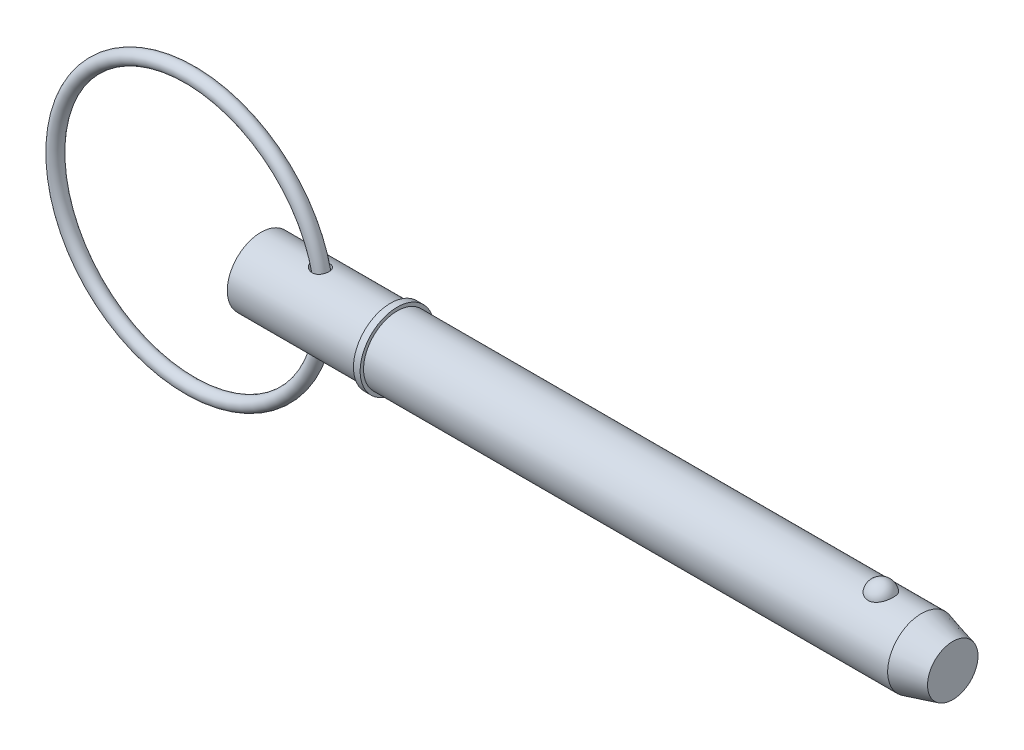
ISO-10303-21;
HEADER;
FILE_DESCRIPTION(('STEP AP214'),'2;1');
FILE_NAME('part.step','',(''),(''),'','','');
FILE_SCHEMA(('AUTOMOTIVE_DESIGN { 1 0 10303 214 1 1 1 1 }'));
ENDSEC;
DATA;
#1=APPLICATION_CONTEXT('core data for automotive mechanical design processes');
#2=APPLICATION_PROTOCOL_DEFINITION('international standard','automotive_design',2000,#1);
#3=PRODUCT_CONTEXT('',#1,'mechanical');
#4=PRODUCT('Part','Part','',(#3));
#5=PRODUCT_RELATED_PRODUCT_CATEGORY('part','',(#4));
#6=PRODUCT_DEFINITION_FORMATION('','',#4);
#7=PRODUCT_DEFINITION_CONTEXT('part definition',#1,'design');
#8=PRODUCT_DEFINITION('design','',#6,#7);
#9=PRODUCT_DEFINITION_SHAPE('','',#8);
#10=(LENGTH_UNIT() NAMED_UNIT(*) SI_UNIT(.MILLI.,.METRE.));
#11=(NAMED_UNIT(*) PLANE_ANGLE_UNIT() SI_UNIT($,.RADIAN.));
#12=(NAMED_UNIT(*) SI_UNIT($,.STERADIAN.) SOLID_ANGLE_UNIT());
#13=UNCERTAINTY_MEASURE_WITH_UNIT(LENGTH_MEASURE(1.E-05),#10,'distance_accuracy_value','');
#14=(GEOMETRIC_REPRESENTATION_CONTEXT(3) GLOBAL_UNCERTAINTY_ASSIGNED_CONTEXT((#13)) GLOBAL_UNIT_ASSIGNED_CONTEXT((#10,
#11,#12)) REPRESENTATION_CONTEXT('',''));
#15=CARTESIAN_POINT('',(0.,0.,0.));
#16=DIRECTION('',(0.,0.,1.));
#17=DIRECTION('',(1.,0.,0.));
#18=AXIS2_PLACEMENT_3D('',#15,#16,#17);
#19=CARTESIAN_POINT('',(-13.3798047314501,0.,0.));
#20=DIRECTION('',(0.,0.,1.));
#21=DIRECTION('',(1.,0.,0.));
#22=AXIS2_PLACEMENT_3D('',#19,#20,#21);
#23=TOROIDAL_SURFACE('',#22,25.4,1.27);
#24=CARTESIAN_POINT('',(13.2901952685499,0.,0.));
#25=VERTEX_POINT('',#24);
#26=VERTEX_LOOP('',#25);
#27=FACE_BOUND('',#26,.T.);
#28=ADVANCED_FACE('P0_F12',(#27),#23,.T.);
#29=CLOSED_SHELL('',(#28));
#30=MANIFOLD_SOLID_BREP('P0_B1',#29);
#31=CARTESIAN_POINT('',(0.,0.,0.));
#32=DIRECTION('',(1.,0.,0.));
#33=DIRECTION('',(0.,0.,-1.));
#34=AXIS2_PLACEMENT_3D('',#31,#32,#33);
#35=CYLINDRICAL_SURFACE('',#34,6.35);
#36=CARTESIAN_POINT('',(9.67500140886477,6.32698634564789,-0.540133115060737));
#37=CARTESIAN_POINT('',(9.70878953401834,6.3197498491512,-0.624879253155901));
#38=CARTESIAN_POINT('',(9.75028044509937,6.31105328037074,-0.706504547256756));
#39=CARTESIAN_POINT('',(9.84659255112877,6.29180070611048,-0.861319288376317));
#40=CARTESIAN_POINT('',(9.90144039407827,6.28124099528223,-0.934491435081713));
#41=CARTESIAN_POINT('',(10.021999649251,6.25949497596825,-1.0704877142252));
#42=CARTESIAN_POINT('',(10.0876589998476,6.2483118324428,-1.13335868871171));
#43=CARTESIAN_POINT('',(10.2280180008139,6.22641783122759,-1.24805262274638));
#44=CARTESIAN_POINT('',(10.3027159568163,6.21570688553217,-1.29987764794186));
#45=CARTESIAN_POINT('',(10.4650889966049,6.19509606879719,-1.39492899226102));
#46=CARTESIAN_POINT('',(10.5533142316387,6.1853135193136,-1.4372443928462));
#47=CARTESIAN_POINT('',(10.7357818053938,6.16871128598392,-1.50691441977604));
#48=CARTESIAN_POINT('',(10.8300253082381,6.16189217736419,-1.53426614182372));
#49=CARTESIAN_POINT('',(11.0227953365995,6.15211299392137,-1.57302798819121));
#50=CARTESIAN_POINT('',(11.1213511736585,6.14918579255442,-1.58430237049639));
#51=CARTESIAN_POINT('',(11.3189518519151,6.1478413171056,-1.58951619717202));
#52=CARTESIAN_POINT('',(11.417996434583,6.14942187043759,-1.58346399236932));
#53=CARTESIAN_POINT('',(11.6070859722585,6.15678569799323,-1.55457003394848));
#54=CARTESIAN_POINT('',(11.6973059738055,6.16229943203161,-1.53280404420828));
#55=CARTESIAN_POINT('',(11.8723373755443,6.17663058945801,-1.4739892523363));
#56=CARTESIAN_POINT('',(11.9571502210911,6.185447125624,-1.43694455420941));
#57=CARTESIAN_POINT('',(12.1146737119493,6.20482821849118,-1.35072170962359));
#58=CARTESIAN_POINT('',(12.1877743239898,6.21528554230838,-1.30222952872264));
#59=CARTESIAN_POINT('',(12.3246187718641,6.23705116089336,-1.19362916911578));
#60=CARTESIAN_POINT('',(12.3883628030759,6.24835943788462,-1.1335212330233));
#61=CARTESIAN_POINT('',(12.5046662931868,6.27053957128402,-1.00357204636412));
#62=CARTESIAN_POINT('',(12.5572571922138,6.28141258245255,-0.933759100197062));
#63=CARTESIAN_POINT('',(12.6502125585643,6.30157953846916,-0.786214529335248));
#64=CARTESIAN_POINT('',(12.6905764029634,6.31087340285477,-0.708482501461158));
#65=CARTESIAN_POINT('',(12.7585531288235,6.32699259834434,-0.546246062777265));
#66=CARTESIAN_POINT('',(12.7860022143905,6.33378599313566,-0.46166981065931));
#67=CARTESIAN_POINT('',(12.8267605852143,6.34401050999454,-0.288980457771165));
#68=CARTESIAN_POINT('',(12.8400695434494,6.34744155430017,-0.200867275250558));
#69=CARTESIAN_POINT('',(12.8522644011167,6.35058177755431,-0.023194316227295));
#70=CARTESIAN_POINT('',(12.8510870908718,6.35027464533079,0.0663700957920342));
#71=CARTESIAN_POINT('',(12.8341831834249,6.34593169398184,0.244024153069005));
#72=CARTESIAN_POINT('',(12.8184563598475,6.341895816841,0.332113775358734));
#73=CARTESIAN_POINT('',(12.7728208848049,6.33052992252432,0.504322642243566));
#74=CARTESIAN_POINT('',(12.7429114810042,6.32319973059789,0.58844167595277));
#75=CARTESIAN_POINT('',(12.6696162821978,6.30604116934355,0.750316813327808));
#76=CARTESIAN_POINT('',(12.6262302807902,6.29621276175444,0.828072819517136));
#77=CARTESIAN_POINT('',(12.5270856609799,6.27515240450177,0.974918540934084));
#78=CARTESIAN_POINT('',(12.4713403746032,6.26392197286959,1.04401746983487));
#79=CARTESIAN_POINT('',(12.3488662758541,6.24131002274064,1.1716478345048));
#80=CARTESIAN_POINT('',(12.2821384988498,6.22992851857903,1.23018026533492));
#81=CARTESIAN_POINT('',(12.1401870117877,6.20841765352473,1.33449214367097));
#82=CARTESIAN_POINT('',(12.0650507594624,6.19827734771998,1.38038832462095));
#83=CARTESIAN_POINT('',(11.9079044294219,6.18026478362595,1.45892404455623));
#84=CARTESIAN_POINT('',(11.8258951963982,6.17239224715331,1.49156520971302));
#85=CARTESIAN_POINT('',(11.6581736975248,6.15982613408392,1.54263810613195));
#86=CARTESIAN_POINT('',(11.572502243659,6.15510409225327,1.56119728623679));
#87=CARTESIAN_POINT('',(11.3991899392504,6.14916283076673,1.58443707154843));
#88=CARTESIAN_POINT('',(11.3115488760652,6.14794399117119,1.58911617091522));
#89=CARTESIAN_POINT('',(11.1345547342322,6.14904466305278,1.58485137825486));
#90=CARTESIAN_POINT('',(11.0452104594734,6.15144894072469,1.5755811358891));
#91=CARTESIAN_POINT('',(10.8691479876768,6.15957601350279,1.54349959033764));
#92=CARTESIAN_POINT('',(10.782430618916,6.16529984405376,1.52068406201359));
#93=CARTESIAN_POINT('',(10.6082848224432,6.17983892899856,1.4605156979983));
#94=CARTESIAN_POINT('',(10.5211557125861,6.1888262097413,1.42233764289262));
#95=CARTESIAN_POINT('',(10.3542377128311,6.20874782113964,1.33268652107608));
#96=CARTESIAN_POINT('',(10.2744521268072,6.21968302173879,1.28120750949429));
#97=CARTESIAN_POINT('',(10.120854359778,6.24282707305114,1.16334748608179));
#98=CARTESIAN_POINT('',(10.0474902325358,6.25507146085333,1.09638652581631));
#99=CARTESIAN_POINT('',(9.9136869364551,6.27890019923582,0.950453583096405));
#100=CARTESIAN_POINT('',(9.85324511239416,6.29048468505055,0.871484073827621));
#101=CARTESIAN_POINT('',(9.75037543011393,6.31102161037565,0.707140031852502));
#102=CARTESIAN_POINT('',(9.70726585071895,6.32006820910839,0.622206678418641));
#103=CARTESIAN_POINT('',(9.63775895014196,6.33497125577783,0.445490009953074));
#104=CARTESIAN_POINT('',(9.61134627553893,6.34083063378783,0.35371307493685));
#105=CARTESIAN_POINT('',(9.57891955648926,6.34807071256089,0.177220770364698));
#106=CARTESIAN_POINT('',(9.57093524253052,6.3498832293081,0.0928817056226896));
#107=CARTESIAN_POINT('',(9.56994851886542,6.35010532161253,-0.0758268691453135));
#108=CARTESIAN_POINT('',(9.57692695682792,6.34851924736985,-0.160196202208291));
#109=CARTESIAN_POINT('',(9.59985709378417,6.34339435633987,-0.294043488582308));
#110=CARTESIAN_POINT('',(9.61128951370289,6.34084912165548,-0.344385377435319));
#111=CARTESIAN_POINT('',(9.63933183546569,6.33468615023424,-0.443526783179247));
#112=CARTESIAN_POINT('',(9.65594100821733,6.33106856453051,-0.492326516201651));
#113=CARTESIAN_POINT('',(9.67500140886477,6.32698634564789,-0.540133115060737));
#114=B_SPLINE_CURVE_WITH_KNOTS('',3,(#36,#37,#38,#39,#40,#41,#42,#43,#44,#45,#46,#47,#48,#49,
#50,#51,#52,#53,#54,#55,#56,#57,#58,#59,#60,#61,#62,#63,#64,#65,#66,#67,#68,#69,#70,#71,#72,#73,
#74,#75,#76,#77,#78,#79,#80,#81,#82,#83,#84,#85,#86,#87,#88,#89,#90,#91,#92,#93,#94,#95,#96,#97,
#98,#99,#100,#101,#102,#103,#104,#105,#106,#107,#108,#109,#110,#111,#112,#113),.UNSPECIFIED.,
.T.,.F.,(4,2,2,2,2,2,2,2,2,2,2,2,2,2,2,2,2,2,2,2,2,2,2,2,2,2,2,2,2,2,2,2,2,2,2,2,2,2,4),(0.,
0.274348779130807,0.549249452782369,0.822863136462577,1.09642560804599,1.39007706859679,
1.68378550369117,1.97995934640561,2.27599046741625,2.55347281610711,2.83088067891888,
3.09465189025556,3.35841759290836,3.62142956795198,3.88445494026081,4.1507318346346,
4.4170148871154,4.68446025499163,4.95190978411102,5.21937350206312,5.48684131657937,
5.75402200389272,6.02117751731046,6.28577524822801,6.55034050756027,6.81248178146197,
7.0746514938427,7.34305086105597,7.61153399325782,7.89692981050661,8.18245340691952,
8.48120635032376,8.77989784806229,9.06530254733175,9.35044442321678,9.60331609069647,
9.85586427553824,10.010650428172,10.1654147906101),.UNSPECIFIED.);
#115=CARTESIAN_POINT('',(9.67500140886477,6.32698634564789,-0.540133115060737));
#116=VERTEX_POINT('',#115);
#117=EDGE_CURVE('P1_E42',#116,#116,#114,.T.);
#118=ORIENTED_EDGE('',*,*,#117,.T.);
#119=EDGE_LOOP('',(#118));
#120=FACE_BOUND('',#119,.T.);
#121=CARTESIAN_POINT('',(0.,0.,0.));
#122=DIRECTION('',(1.,0.,0.));
#123=DIRECTION('',(0.,0.,-1.));
#124=AXIS2_PLACEMENT_3D('',#121,#122,#123);
#125=CIRCLE('',#124,6.35);
#126=CARTESIAN_POINT('',(0.,0.,-6.35));
#127=VERTEX_POINT('',#126);
#128=EDGE_CURVE('P1_E9',#127,#127,#125,.T.);
#129=ORIENTED_EDGE('',*,*,#128,.T.);
#130=EDGE_LOOP('',(#129));
#131=FACE_BOUND('',#130,.T.);
#132=CARTESIAN_POINT('',(24.43,0.,0.));
#133=DIRECTION('',(1.,0.,0.));
#134=DIRECTION('',(0.,0.,-1.));
#135=AXIS2_PLACEMENT_3D('',#132,#133,#134);
#136=CIRCLE('',#135,6.35);
#137=CARTESIAN_POINT('',(24.43,0.,-6.35));
#138=VERTEX_POINT('',#137);
#139=EDGE_CURVE('P1_E25',#138,#138,#136,.T.);
#140=ORIENTED_EDGE('',*,*,#139,.F.);
#141=EDGE_LOOP('',(#140));
#142=FACE_BOUND('',#141,.T.);
#143=CARTESIAN_POINT('',(9.67500140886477,-6.32698634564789,-0.540133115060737));
#144=CARTESIAN_POINT('',(9.64544894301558,-6.33331515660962,-0.466002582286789));
#145=CARTESIAN_POINT('',(9.62177180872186,-6.33852974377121,-0.389437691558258));
#146=CARTESIAN_POINT('',(9.58727043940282,-6.34619174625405,-0.233330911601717));
#147=CARTESIAN_POINT('',(9.57644043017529,-6.34864040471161,-0.153790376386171));
#148=CARTESIAN_POINT('',(9.56819517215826,-6.3505010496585,0.00612071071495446));
#149=CARTESIAN_POINT('',(9.57079639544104,-6.34990930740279,0.0864921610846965));
#150=CARTESIAN_POINT('',(9.58930797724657,-6.3457478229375,0.245607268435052));
#151=CARTESIAN_POINT('',(9.60522046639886,-6.34217760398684,0.324350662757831));
#152=CARTESIAN_POINT('',(9.64931570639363,-6.3324977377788,0.47727605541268));
#153=CARTESIAN_POINT('',(9.67737525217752,-6.32641361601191,0.551495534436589));
#154=CARTESIAN_POINT('',(9.74451510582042,-6.31231128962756,0.694551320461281));
#155=CARTESIAN_POINT('',(9.78359827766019,-6.30429258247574,0.763386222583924));
#156=CARTESIAN_POINT('',(9.87474700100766,-6.28638332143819,0.899414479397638));
#157=CARTESIAN_POINT('',(9.92757481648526,-6.27639669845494,0.966083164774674));
#158=CARTESIAN_POINT('',(10.042675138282,-6.25596164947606,1.09061181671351));
#159=CARTESIAN_POINT('',(10.1049521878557,-6.24551300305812,1.14846751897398));
#160=CARTESIAN_POINT('',(10.2445505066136,-6.22397505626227,1.26024641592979));
#161=CARTESIAN_POINT('',(10.3227711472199,-6.2129394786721,1.31305951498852));
#162=CARTESIAN_POINT('',(10.4867924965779,-6.19263757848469,1.40570084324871));
#163=CARTESIAN_POINT('',(10.5725962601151,-6.18337197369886,1.44552380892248));
#164=CARTESIAN_POINT('',(10.7543302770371,-6.16725983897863,1.51283687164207));
#165=CARTESIAN_POINT('',(10.8505554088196,-6.16056505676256,1.53957358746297));
#166=CARTESIAN_POINT('',(11.0463546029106,-6.15127671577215,1.57628137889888));
#167=CARTESIAN_POINT('',(11.1459276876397,-6.14868197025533,1.58625730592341));
#168=CARTESIAN_POINT('',(11.3414257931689,-6.14810798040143,1.58848000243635));
#169=CARTESIAN_POINT('',(11.4373417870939,-6.14995283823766,1.58140242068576));
#170=CARTESIAN_POINT('',(11.6262783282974,-6.1577972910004,1.55057566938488));
#171=CARTESIAN_POINT('',(11.719300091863,-6.16379511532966,1.52683360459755));
#172=CARTESIAN_POINT('',(11.8934223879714,-6.17873566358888,1.46514575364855));
#173=CARTESIAN_POINT('',(11.9749048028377,-6.18746207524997,1.42822144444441));
#174=CARTESIAN_POINT('',(12.1301362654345,-6.20693584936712,1.3410564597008));
#175=CARTESIAN_POINT('',(12.2038861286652,-6.21768299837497,1.29081719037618));
#176=CARTESIAN_POINT('',(12.3399792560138,-6.23970077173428,1.17972764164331));
#177=CARTESIAN_POINT('',(12.4025430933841,-6.25095401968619,1.11914355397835));
#178=CARTESIAN_POINT('',(12.5166805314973,-6.27296916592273,0.988307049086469));
#179=CARTESIAN_POINT('',(12.568253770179,-6.28373104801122,0.918054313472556));
#180=CARTESIAN_POINT('',(12.6596230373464,-6.3037060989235,0.769081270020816));
#181=CARTESIAN_POINT('',(12.6992956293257,-6.31290263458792,0.690283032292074));
#182=CARTESIAN_POINT('',(12.7652258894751,-6.32862394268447,0.527011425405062));
#183=CARTESIAN_POINT('',(12.7914829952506,-6.33514860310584,0.442537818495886));
#184=CARTESIAN_POINT('',(12.8301436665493,-6.34487485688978,0.269505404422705));
#185=CARTESIAN_POINT('',(12.8424230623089,-6.34804664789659,0.180917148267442));
#186=CARTESIAN_POINT('',(12.8524214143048,-6.35062347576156,0.00286829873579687));
#187=CARTESIAN_POINT('',(12.8501402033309,-6.35002846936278,-0.0865923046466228));
#188=CARTESIAN_POINT('',(12.8310619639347,-6.34513332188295,-0.263931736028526));
#189=CARTESIAN_POINT('',(12.8142517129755,-6.34082980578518,-0.35180904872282));
#190=CARTESIAN_POINT('',(12.7664911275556,-6.32897674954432,-0.523406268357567));
#191=CARTESIAN_POINT('',(12.7355404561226,-6.3214271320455,-0.607126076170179));
#192=CARTESIAN_POINT('',(12.6602298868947,-6.30390232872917,-0.768030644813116));
#193=CARTESIAN_POINT('',(12.6158695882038,-6.29392707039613,-0.84521521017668));
#194=CARTESIAN_POINT('',(12.5148171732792,-6.2726521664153,-0.990836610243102));
#195=CARTESIAN_POINT('',(12.4581254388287,-6.26135256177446,-1.05927371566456));
#196=CARTESIAN_POINT('',(12.33416419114,-6.2387572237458,-1.18510935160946));
#197=CARTESIAN_POINT('',(12.2669484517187,-6.22746174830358,-1.24256086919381));
#198=CARTESIAN_POINT('',(12.1235592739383,-6.20610255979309,-1.34519464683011));
#199=CARTESIAN_POINT('',(12.0473871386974,-6.19603866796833,-1.39037868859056));
#200=CARTESIAN_POINT('',(11.8892714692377,-6.17839642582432,-1.46678006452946));
#201=CARTESIAN_POINT('',(11.8074126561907,-6.17078838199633,-1.49816605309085));
#202=CARTESIAN_POINT('',(11.6394563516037,-6.15869606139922,-1.54712759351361));
#203=CARTESIAN_POINT('',(11.5533589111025,-6.15421174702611,-1.56470331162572));
#204=CARTESIAN_POINT('',(11.3789660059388,-6.14876652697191,-1.58596734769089));
#205=CARTESIAN_POINT('',(11.2906621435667,-6.1478222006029,-1.58959032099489));
#206=CARTESIAN_POINT('',(11.1146029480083,-6.149490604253,-1.58312110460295));
#207=CARTESIAN_POINT('',(11.0268477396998,-6.1521041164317,-1.57302589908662));
#208=CARTESIAN_POINT('',(10.8498668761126,-6.16071031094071,-1.53898332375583));
#209=CARTESIAN_POINT('',(10.7607726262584,-6.16685908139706,-1.51439468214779));
#210=CARTESIAN_POINT('',(10.5876521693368,-6.18189031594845,-1.45181305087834));
#211=CARTESIAN_POINT('',(10.5036282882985,-6.19077402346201,-1.41381396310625));
#212=CARTESIAN_POINT('',(10.3374228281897,-6.2109378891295,-1.32252480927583));
#213=CARTESIAN_POINT('',(10.255708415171,-6.2223355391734,-1.26840756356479));
#214=CARTESIAN_POINT('',(10.1025645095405,-6.24580740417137,-1.14725208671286));
#215=CARTESIAN_POINT('',(10.0311354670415,-6.25788164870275,-1.08021329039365));
#216=CARTESIAN_POINT('',(9.90472699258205,-6.2806176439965,-0.938710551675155));
#217=CARTESIAN_POINT('',(9.84904456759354,-6.29132066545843,-0.864883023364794));
#218=CARTESIAN_POINT('',(9.75129345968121,-6.31084098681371,-0.708496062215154));
#219=CARTESIAN_POINT('',(9.70921094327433,-6.31966019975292,-0.625945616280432));
#220=CARTESIAN_POINT('',(9.67500140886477,-6.32698634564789,-0.540133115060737));
#221=B_SPLINE_CURVE_WITH_KNOTS('',3,(#143,#144,#145,#146,#147,#148,#149,#150,#151,#152,#153,
#154,#155,#156,#157,#158,#159,#160,#161,#162,#163,#164,#165,#166,#167,#168,#169,#170,#171,#172,
#173,#174,#175,#176,#177,#178,#179,#180,#181,#182,#183,#184,#185,#186,#187,#188,#189,#190,#191,
#192,#193,#194,#195,#196,#197,#198,#199,#200,#201,#202,#203,#204,#205,#206,#207,#208,#209,#210,
#211,#212,#213,#214,#215,#216,#217,#218,#219,#220),.UNSPECIFIED.,.T.,.F.,(4,2,2,2,2,2,2,2,2,2,2,
2,2,2,2,2,2,2,2,2,2,2,2,2,2,2,2,2,2,2,2,2,2,2,2,2,2,2,4),(0.,0.239871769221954,
0.479635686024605,0.719693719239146,0.959790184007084,1.19750645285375,1.43528453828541,
1.69117930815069,1.94719750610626,2.23102979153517,2.51497694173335,2.81376497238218,
3.11246650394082,3.39952951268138,3.68647020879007,3.95479420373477,4.22308987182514,
4.48530700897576,4.74753278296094,5.01239119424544,5.27726070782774,5.54446524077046,
5.81167284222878,6.07912387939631,6.34658129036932,6.61404669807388,6.88150382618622,
7.14763644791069,7.41373039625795,7.67647472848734,7.93921589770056,8.20318607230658,
8.46721428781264,8.74390821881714,9.02072813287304,9.31537622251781,9.61003720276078,
9.88799314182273,10.1656654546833),.UNSPECIFIED.);
#222=CARTESIAN_POINT('',(9.67500140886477,-6.32698634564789,-0.540133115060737));
#223=VERTEX_POINT('',#222);
#224=EDGE_CURVE('P1_E17',#223,#223,#221,.T.);
#225=ORIENTED_EDGE('',*,*,#224,.T.);
#226=EDGE_LOOP('',(#225));
#227=FACE_BOUND('',#226,.T.);
#228=ADVANCED_FACE('P1_F13',(#120,#131,#142,#227),#35,.T.);
#229=CARTESIAN_POINT('',(0.,0.,0.));
#230=DIRECTION('',(1.,0.,0.));
#231=DIRECTION('',(0.,0.,-1.));
#232=AXIS2_PLACEMENT_3D('',#229,#230,#231);
#233=CYLINDRICAL_SURFACE('',#232,6.35);
#234=CARTESIAN_POINT('',(124.555369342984,0.,0.));
#235=DIRECTION('',(1.,0.,0.));
#236=DIRECTION('',(0.,0.,-1.));
#237=AXIS2_PLACEMENT_3D('',#234,#235,#236);
#238=CIRCLE('',#237,6.35);
#239=CARTESIAN_POINT('',(124.555369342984,0.,-6.35));
#240=VERTEX_POINT('',#239);
#241=EDGE_CURVE('P1_E99',#240,#240,#238,.T.);
#242=ORIENTED_EDGE('',*,*,#241,.F.);
#243=EDGE_LOOP('',(#242));
#244=FACE_BOUND('',#243,.T.);
#245=CARTESIAN_POINT('',(25.7,0.,0.));
#246=DIRECTION('',(1.,0.,0.));
#247=DIRECTION('',(0.,0.,-1.));
#248=AXIS2_PLACEMENT_3D('',#245,#246,#247);
#249=CIRCLE('',#248,6.35);
#250=CARTESIAN_POINT('',(25.7,0.,-6.35));
#251=VERTEX_POINT('',#250);
#252=EDGE_CURVE('P1_E96',#251,#251,#249,.T.);
#253=ORIENTED_EDGE('',*,*,#252,.T.);
#254=EDGE_LOOP('',(#253));
#255=FACE_BOUND('',#254,.T.);
#256=CARTESIAN_POINT('',(116.930021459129,5.87502187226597,2.40969251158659));
#257=CARTESIAN_POINT('',(116.805030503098,5.87501645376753,2.40969773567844));
#258=CARTESIAN_POINT('',(116.680080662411,5.87916061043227,2.39967292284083));
#259=CARTESIAN_POINT('',(116.433909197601,5.8952311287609,2.35991730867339));
#260=CARTESIAN_POINT('',(116.312686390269,5.90715499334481,2.33019283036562));
#261=CARTESIAN_POINT('',(116.077517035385,5.93739567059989,2.25201402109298));
#262=CARTESIAN_POINT('',(115.963560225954,5.95570321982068,2.2035868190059));
#263=CARTESIAN_POINT('',(115.74557352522,5.99672067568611,2.08937987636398));
#264=CARTESIAN_POINT('',(115.641545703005,6.01943149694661,2.02359652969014));
#265=CARTESIAN_POINT('',(115.442943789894,6.06760647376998,1.87428969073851));
#266=CARTESIAN_POINT('',(115.348726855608,6.09313095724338,1.79031110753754));
#267=CARTESIAN_POINT('',(115.175255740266,6.14375873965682,1.60800178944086));
#268=CARTESIAN_POINT('',(115.096004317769,6.16886196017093,1.50966841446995));
#269=CARTESIAN_POINT('',(114.950845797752,6.21724600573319,1.29645884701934));
#270=CARTESIAN_POINT('',(114.885688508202,6.24039621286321,1.18104158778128));
#271=CARTESIAN_POINT('',(114.774703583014,6.28117277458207,0.940351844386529));
#272=CARTESIAN_POINT('',(114.728877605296,6.29879865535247,0.815078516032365));
#273=CARTESIAN_POINT('',(114.657023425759,6.32692073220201,0.556494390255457));
#274=CARTESIAN_POINT('',(114.631249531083,6.33732517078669,0.423102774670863));
#275=CARTESIAN_POINT('',(114.600988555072,6.34957673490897,0.153542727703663));
#276=CARTESIAN_POINT('',(114.596500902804,6.35142408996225,0.0173743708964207));
#277=CARTESIAN_POINT('',(114.608865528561,6.34638925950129,-0.253036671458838));
#278=CARTESIAN_POINT('',(114.625594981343,6.33955731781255,-0.387285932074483));
#279=CARTESIAN_POINT('',(114.679843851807,6.31794129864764,-0.650851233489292));
#280=CARTESIAN_POINT('',(114.717363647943,6.30315707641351,-0.780167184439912));
#281=CARTESIAN_POINT('',(114.812500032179,6.26711642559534,-1.03041949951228));
#282=CARTESIAN_POINT('',(114.870143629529,6.24585130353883,-1.15134433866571));
#283=CARTESIAN_POINT('',(115.004352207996,6.19905619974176,-1.38129800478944));
#284=CARTESIAN_POINT('',(115.080918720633,6.17352587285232,-1.49032586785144));
#285=CARTESIAN_POINT('',(115.251753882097,6.12080227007,-1.69393164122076));
#286=CARTESIAN_POINT('',(115.346100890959,6.09360200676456,-1.78844209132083));
#287=CARTESIAN_POINT('',(115.550119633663,6.04070434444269,-1.95970536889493));
#288=CARTESIAN_POINT('',(115.659790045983,6.01500681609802,-2.03645972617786));
#289=CARTESIAN_POINT('',(115.889187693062,5.96867714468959,-2.1684564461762));
#290=CARTESIAN_POINT('',(116.008652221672,5.94794910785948,-2.22412062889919));
#291=CARTESIAN_POINT('',(116.256218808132,5.91340580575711,-2.31440992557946));
#292=CARTESIAN_POINT('',(116.384317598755,5.89958794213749,-2.3490429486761));
#293=CARTESIAN_POINT('',(116.638582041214,5.88111049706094,-2.39491590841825));
#294=CARTESIAN_POINT('',(116.764520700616,5.876025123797,-2.40724512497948));
#295=CARTESIAN_POINT('',(117.016786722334,5.87428980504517,-2.41147867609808));
#296=CARTESIAN_POINT('',(117.143114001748,5.87763817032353,-2.40338710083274));
#297=CARTESIAN_POINT('',(117.388417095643,5.89212921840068,-2.36762715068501));
#298=CARTESIAN_POINT('',(117.507499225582,5.90302431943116,-2.34058030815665));
#299=CARTESIAN_POINT('',(117.73924472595,5.93113752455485,-2.26839066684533));
#300=CARTESIAN_POINT('',(117.851907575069,5.94835614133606,-2.2232464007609));
#301=CARTESIAN_POINT('',(118.070400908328,5.98773016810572,-2.11493806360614));
#302=CARTESIAN_POINT('',(118.176028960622,6.00998499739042,-2.05140269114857));
#303=CARTESIAN_POINT('',(118.375300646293,6.05690144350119,-1.90842705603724));
#304=CARTESIAN_POINT('',(118.468941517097,6.08156361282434,-1.82898313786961));
#305=CARTESIAN_POINT('',(118.646675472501,6.13211715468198,-1.65182429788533));
#306=CARTESIAN_POINT('',(118.730055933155,6.15800825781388,-1.55339381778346));
#307=CARTESIAN_POINT('',(118.879790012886,6.20712834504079,-1.34374214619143));
#308=CARTESIAN_POINT('',(118.946140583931,6.23035685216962,-1.23251867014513));
#309=CARTESIAN_POINT('',(119.062345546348,6.27251177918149,-0.996447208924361));
#310=CARTESIAN_POINT('',(119.111607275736,6.29127762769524,-0.871278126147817));
#311=CARTESIAN_POINT('',(119.189614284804,6.3215862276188,-0.613870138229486));
#312=CARTESIAN_POINT('',(119.218359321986,6.33312889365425,-0.481631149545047));
#313=CARTESIAN_POINT('',(119.25477058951,6.34782349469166,-0.213672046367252));
#314=CARTESIAN_POINT('',(119.262413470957,6.35096613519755,-0.0779482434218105));
#315=CARTESIAN_POINT('',(119.256395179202,6.34851322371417,0.19294395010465));
#316=CARTESIAN_POINT('',(119.242734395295,6.3429178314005,0.328112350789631));
#317=CARTESIAN_POINT('',(119.19450361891,6.32360512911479,0.59340618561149));
#318=CARTESIAN_POINT('',(119.160031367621,6.30992579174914,0.723552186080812));
#319=CARTESIAN_POINT('',(119.070953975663,6.27586325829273,0.975834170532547));
#320=CARTESIAN_POINT('',(119.01634761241,6.25547965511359,1.09796966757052));
#321=CARTESIAN_POINT('',(118.88775879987,6.20998183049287,1.33148921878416));
#322=CARTESIAN_POINT('',(118.813674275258,6.18484288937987,1.44281227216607));
#323=CARTESIAN_POINT('',(118.647820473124,6.13258735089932,1.65087683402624));
#324=CARTESIAN_POINT('',(118.556051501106,6.10547078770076,1.74761859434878));
#325=CARTESIAN_POINT('',(118.357183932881,6.0523587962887,1.92350926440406));
#326=CARTESIAN_POINT('',(118.250133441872,6.0263601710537,2.00271146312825));
#327=CARTESIAN_POINT('',(118.023138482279,5.97843747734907,2.14154159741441));
#328=CARTESIAN_POINT('',(117.903191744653,5.95651412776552,2.20116608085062));
#329=CARTESIAN_POINT('',(117.644523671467,5.91812106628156,2.30250570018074));
#330=CARTESIAN_POINT('',(117.50506980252,5.90217533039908,2.34256795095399));
#331=CARTESIAN_POINT('',(117.220397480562,5.88063128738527,2.39615214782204));
#332=CARTESIAN_POINT('',(117.07518174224,5.8750281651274,2.40968644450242));
#333=CARTESIAN_POINT('',(116.930021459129,5.87502187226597,2.40969251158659));
#334=B_SPLINE_CURVE_WITH_KNOTS('',3,(#256,#257,#258,#259,#260,#261,#262,#263,#264,#265,#266,
#267,#268,#269,#270,#271,#272,#273,#274,#275,#276,#277,#278,#279,#280,#281,#282,#283,#284,#285,
#286,#287,#288,#289,#290,#291,#292,#293,#294,#295,#296,#297,#298,#299,#300,#301,#302,#303,#304,
#305,#306,#307,#308,#309,#310,#311,#312,#313,#314,#315,#316,#317,#318,#319,#320,#321,#322,#323,
#324,#325,#326,#327,#328,#329,#330,#331,#332,#333),.UNSPECIFIED.,.T.,.F.,(4,2,2,2,2,2,2,2,2,2,2,
2,2,2,2,2,2,2,2,2,2,2,2,2,2,2,2,2,2,2,2,2,2,2,2,2,2,2,4),(0.,0.374440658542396,
0.748761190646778,1.12254078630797,1.49639810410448,1.88098871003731,2.26565013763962,
2.66741104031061,3.06920639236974,3.47601794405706,3.88281858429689,4.28727498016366,
4.69173873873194,5.09674745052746,5.50178895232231,5.90865911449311,6.31549420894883,
6.71369855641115,7.11175305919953,7.48978077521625,7.86773278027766,8.2338388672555,
8.59997464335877,8.97409044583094,9.34829231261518,9.74122667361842,10.1342313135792,
10.5397522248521,10.9452779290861,11.3512521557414,11.7572189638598,12.1612938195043,
12.5653932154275,12.9716540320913,13.3779078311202,13.7829098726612,14.1879832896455,
14.6230486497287,15.0579114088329),.UNSPECIFIED.);
#335=CARTESIAN_POINT('',(116.930021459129,5.87502187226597,2.40969251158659));
#336=VERTEX_POINT('',#335);
#337=EDGE_CURVE('P1_E34',#336,#336,#334,.T.);
#338=ORIENTED_EDGE('',*,*,#337,.T.);
#339=EDGE_LOOP('',(#338));
#340=FACE_BOUND('',#339,.T.);
#341=ADVANCED_FACE('P1_F46',(#244,#255,#340),#233,.T.);
#342=CARTESIAN_POINT('',(0.,0.,0.));
#343=DIRECTION('',(-1.,0.,0.));
#344=DIRECTION('',(0.,0.,1.));
#345=AXIS2_PLACEMENT_3D('',#342,#343,#344);
#346=PLANE('',#345);
#347=ORIENTED_EDGE('',*,*,#128,.F.);
#348=EDGE_LOOP('',(#347));
#349=FACE_BOUND('',#348,.T.);
#350=ADVANCED_FACE('P1_F15',(#349),#346,.T.);
#351=CARTESIAN_POINT('',(24.43,6.35,0.));
#352=DIRECTION('',(-1.,0.,0.));
#353=DIRECTION('',(0.,0.,1.));
#354=AXIS2_PLACEMENT_3D('',#351,#352,#353);
#355=PLANE('',#354);
#356=ORIENTED_EDGE('',*,*,#139,.T.);
#357=EDGE_LOOP('',(#356));
#358=FACE_BOUND('',#357,.T.);
#359=CARTESIAN_POINT('',(24.43,0.,0.));
#360=DIRECTION('',(1.,0.,0.));
#361=DIRECTION('',(0.,0.,-1.));
#362=AXIS2_PLACEMENT_3D('',#359,#360,#361);
#363=CIRCLE('',#362,6.985);
#364=CARTESIAN_POINT('',(24.43,0.,-6.985));
#365=VERTEX_POINT('',#364);
#366=EDGE_CURVE('P1_E30',#365,#365,#363,.T.);
#367=ORIENTED_EDGE('',*,*,#366,.F.);
#368=EDGE_LOOP('',(#367));
#369=FACE_BOUND('',#368,.T.);
#370=ADVANCED_FACE('P1_F81',(#358,#369),#355,.T.);
#371=CARTESIAN_POINT('',(0.,0.,0.));
#372=DIRECTION('',(1.,0.,0.));
#373=DIRECTION('',(0.,0.,-1.));
#374=AXIS2_PLACEMENT_3D('',#371,#372,#373);
#375=CYLINDRICAL_SURFACE('',#374,6.985);
#376=ORIENTED_EDGE('',*,*,#366,.T.);
#377=EDGE_LOOP('',(#376));
#378=FACE_BOUND('',#377,.T.);
#379=CARTESIAN_POINT('',(25.7,0.,0.));
#380=DIRECTION('',(1.,0.,0.));
#381=DIRECTION('',(0.,0.,-1.));
#382=AXIS2_PLACEMENT_3D('',#379,#380,#381);
#383=CIRCLE('',#382,6.985);
#384=CARTESIAN_POINT('',(25.7,0.,-6.985));
#385=VERTEX_POINT('',#384);
#386=EDGE_CURVE('P1_E95',#385,#385,#383,.T.);
#387=ORIENTED_EDGE('',*,*,#386,.F.);
#388=EDGE_LOOP('',(#387));
#389=FACE_BOUND('',#388,.T.);
#390=ADVANCED_FACE('P1_F68',(#378,#389),#375,.T.);
#391=CARTESIAN_POINT('',(25.7,6.985,0.));
#392=DIRECTION('',(1.,0.,0.));
#393=DIRECTION('',(0.,0.,-1.));
#394=AXIS2_PLACEMENT_3D('',#391,#392,#393);
#395=PLANE('',#394);
#396=ORIENTED_EDGE('',*,*,#386,.T.);
#397=EDGE_LOOP('',(#396));
#398=FACE_BOUND('',#397,.T.);
#399=ORIENTED_EDGE('',*,*,#252,.F.);
#400=EDGE_LOOP('',(#399));
#401=FACE_BOUND('',#400,.T.);
#402=ADVANCED_FACE('P1_F62',(#398,#401),#395,.T.);
#403=CARTESIAN_POINT('',(130.48,0.,0.));
#404=DIRECTION('',(-1.,0.,0.));
#405=DIRECTION('',(0.,0.,1.));
#406=AXIS2_PLACEMENT_3D('',#403,#404,#405);
#407=CONICAL_SURFACE('',#406,4.76250000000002,0.26179938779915);
#408=ORIENTED_EDGE('',*,*,#241,.T.);
#409=EDGE_LOOP('',(#408));
#410=FACE_BOUND('',#409,.T.);
#411=CARTESIAN_POINT('',(130.48,0.,0.));
#412=DIRECTION('',(1.,0.,0.));
#413=DIRECTION('',(0.,0.,-1.));
#414=AXIS2_PLACEMENT_3D('',#411,#412,#413);
#415=CIRCLE('',#414,4.76250000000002);
#416=CARTESIAN_POINT('',(130.48,0.,-4.76250000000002));
#417=VERTEX_POINT('',#416);
#418=EDGE_CURVE('P1_E41',#417,#417,#415,.T.);
#419=ORIENTED_EDGE('',*,*,#418,.F.);
#420=EDGE_LOOP('',(#419));
#421=FACE_BOUND('',#420,.T.);
#422=ADVANCED_FACE('P1_F59',(#410,#421),#407,.T.);
#423=CARTESIAN_POINT('',(130.48,4.76250000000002,0.));
#424=DIRECTION('',(1.,0.,0.));
#425=DIRECTION('',(0.,0.,-1.));
#426=AXIS2_PLACEMENT_3D('',#423,#424,#425);
#427=PLANE('',#426);
#428=ORIENTED_EDGE('',*,*,#418,.T.);
#429=EDGE_LOOP('',(#428));
#430=FACE_BOUND('',#429,.T.);
#431=ADVANCED_FACE('P1_F55',(#430),#427,.T.);
#432=CARTESIAN_POINT('',(116.930021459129,5.715,0.));
#433=DIRECTION('',(-1.,0.,0.));
#434=DIRECTION('',(0.,1.,0.));
#435=AXIS2_PLACEMENT_3D('',#432,#433,#434);
#436=SPHERICAL_SURFACE('',#435,2.415);
#437=ORIENTED_EDGE('',*,*,#337,.F.);
#438=EDGE_LOOP('',(#437));
#439=FACE_BOUND('',#438,.T.);
#440=ADVANCED_FACE('P1_F50',(#439),#436,.T.);
#441=CARTESIAN_POINT('',(-13.3798047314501,0.,0.));
#442=DIRECTION('',(0.,0.,1.));
#443=DIRECTION('',(1.,0.,0.));
#444=AXIS2_PLACEMENT_3D('',#441,#442,#443);
#445=TOROIDAL_SURFACE('',#444,25.4,1.5875);
#446=ORIENTED_EDGE('',*,*,#224,.F.);
#447=EDGE_LOOP('',(#446));
#448=FACE_BOUND('',#447,.T.);
#449=ORIENTED_EDGE('',*,*,#117,.F.);
#450=EDGE_LOOP('',(#449));
#451=FACE_BOUND('',#450,.T.);
#452=ADVANCED_FACE('P1_F54',(#448,#451),#445,.F.);
#453=CLOSED_SHELL('',(#228,#341,#350,#370,#390,#402,#422,#431,#440,#452));
#454=MANIFOLD_SOLID_BREP('P1_B1',#453);
#455=ADVANCED_BREP_SHAPE_REPRESENTATION('',(#18,#30,#454),#14);
#456=SHAPE_DEFINITION_REPRESENTATION(#9,#455);
ENDSEC;
END-ISO-10303-21;
